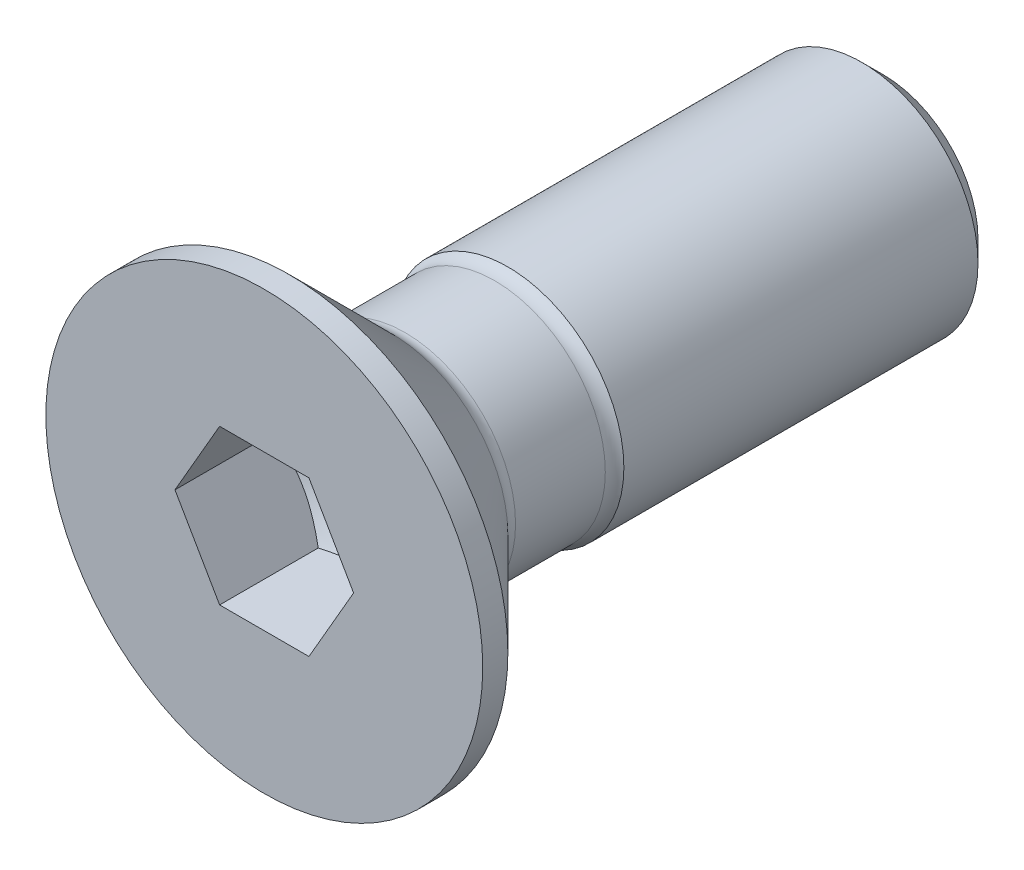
ISO-10303-21;
HEADER;
FILE_DESCRIPTION(('STEP AP214'),'2;1');
FILE_NAME('part.step','',(''),(''),'','','');
FILE_SCHEMA(('AUTOMOTIVE_DESIGN { 1 0 10303 214 1 1 1 1 }'));
ENDSEC;
DATA;
#1=APPLICATION_CONTEXT('core data for automotive mechanical design processes');
#2=APPLICATION_PROTOCOL_DEFINITION('international standard','automotive_design',2000,#1);
#3=PRODUCT_CONTEXT('',#1,'mechanical');
#4=PRODUCT('Part','Part','',(#3));
#5=PRODUCT_RELATED_PRODUCT_CATEGORY('part','',(#4));
#6=PRODUCT_DEFINITION_FORMATION('','',#4);
#7=PRODUCT_DEFINITION_CONTEXT('part definition',#1,'design');
#8=PRODUCT_DEFINITION('design','',#6,#7);
#9=PRODUCT_DEFINITION_SHAPE('','',#8);
#10=(LENGTH_UNIT() NAMED_UNIT(*) SI_UNIT(.MILLI.,.METRE.));
#11=(NAMED_UNIT(*) PLANE_ANGLE_UNIT() SI_UNIT($,.RADIAN.));
#12=(NAMED_UNIT(*) SI_UNIT($,.STERADIAN.) SOLID_ANGLE_UNIT());
#13=UNCERTAINTY_MEASURE_WITH_UNIT(LENGTH_MEASURE(1.E-05),#10,'distance_accuracy_value','');
#14=(GEOMETRIC_REPRESENTATION_CONTEXT(3) GLOBAL_UNCERTAINTY_ASSIGNED_CONTEXT((#13)) GLOBAL_UNIT_ASSIGNED_CONTEXT((#10,
#11,#12)) REPRESENTATION_CONTEXT('',''));
#15=CARTESIAN_POINT('',(0.,0.,0.));
#16=DIRECTION('',(0.,0.,1.));
#17=DIRECTION('',(1.,0.,0.));
#18=AXIS2_PLACEMENT_3D('',#15,#16,#17);
#19=CARTESIAN_POINT('',(0.,5.65,0.));
#20=DIRECTION('',(0.,0.,-1.));
#21=DIRECTION('',(-1.,0.,0.));
#22=AXIS2_PLACEMENT_3D('',#19,#20,#21);
#23=PLANE('',#22);
#24=CARTESIAN_POINT('',(0.,0.,0.));
#25=DIRECTION('',(0.,0.,1.));
#26=DIRECTION('',(1.,0.,0.));
#27=AXIS2_PLACEMENT_3D('',#24,#25,#26);
#28=CIRCLE('',#27,5.65);
#29=CARTESIAN_POINT('',(5.65,0.,0.));
#30=VERTEX_POINT('',#29);
#31=EDGE_CURVE('E107',#30,#30,#28,.T.);
#32=ORIENTED_EDGE('',*,*,#31,.T.);
#33=EDGE_LOOP('',(#32));
#34=FACE_BOUND('',#33,.T.);
#35=DIRECTION('',(0.5,-0.866025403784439,0.));
#36=VECTOR('',#35,1.);
#37=CARTESIAN_POINT('',(1.155,2.00051868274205,0.));
#38=LINE('',#37,#36);
#39=CARTESIAN_POINT('',(1.155,2.00051868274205,0.));
#40=VERTEX_POINT('',#39);
#41=CARTESIAN_POINT('',(2.31,0.,0.));
#42=VERTEX_POINT('',#41);
#43=EDGE_CURVE('E31',#40,#42,#38,.T.);
#44=ORIENTED_EDGE('',*,*,#43,.T.);
#45=DIRECTION('',(-0.5,-0.866025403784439,0.));
#46=VECTOR('',#45,1.);
#47=CARTESIAN_POINT('',(2.31,0.,0.));
#48=LINE('',#47,#46);
#49=CARTESIAN_POINT('',(1.155,-2.00051868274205,0.));
#50=VERTEX_POINT('',#49);
#51=EDGE_CURVE('E181',#42,#50,#48,.T.);
#52=ORIENTED_EDGE('',*,*,#51,.T.);
#53=DIRECTION('',(-1.,0.,0.));
#54=VECTOR('',#53,1.);
#55=CARTESIAN_POINT('',(1.155,-2.00051868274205,0.));
#56=LINE('',#55,#54);
#57=CARTESIAN_POINT('',(-1.155,-2.00051868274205,0.));
#58=VERTEX_POINT('',#57);
#59=EDGE_CURVE('E232',#50,#58,#56,.T.);
#60=ORIENTED_EDGE('',*,*,#59,.T.);
#61=DIRECTION('',(-0.5,0.866025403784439,0.));
#62=VECTOR('',#61,1.);
#63=CARTESIAN_POINT('',(-1.155,-2.00051868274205,0.));
#64=LINE('',#63,#62);
#65=CARTESIAN_POINT('',(-2.31,0.,0.));
#66=VERTEX_POINT('',#65);
#67=EDGE_CURVE('E230',#58,#66,#64,.T.);
#68=ORIENTED_EDGE('',*,*,#67,.T.);
#69=DIRECTION('',(0.5,0.866025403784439,0.));
#70=VECTOR('',#69,1.);
#71=CARTESIAN_POINT('',(-2.31,0.,0.));
#72=LINE('',#71,#70);
#73=CARTESIAN_POINT('',(-1.155,2.00051868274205,0.));
#74=VERTEX_POINT('',#73);
#75=EDGE_CURVE('E96',#66,#74,#72,.T.);
#76=ORIENTED_EDGE('',*,*,#75,.T.);
#77=DIRECTION('',(1.,0.,0.));
#78=VECTOR('',#77,1.);
#79=CARTESIAN_POINT('',(-1.155,2.00051868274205,0.));
#80=LINE('',#79,#78);
#81=EDGE_CURVE('E92',#74,#40,#80,.T.);
#82=ORIENTED_EDGE('',*,*,#81,.T.);
#83=EDGE_LOOP('',(#44,#52,#60,#68,#76,#82));
#84=FACE_BOUND('',#83,.T.);
#85=ADVANCED_FACE('F17',(#34,#84),#23,.F.);
#86=CARTESIAN_POINT('',(0.,0.,-16.));
#87=DIRECTION('',(0.,0.,1.));
#88=DIRECTION('',(1.,0.,0.));
#89=AXIS2_PLACEMENT_3D('',#86,#87,#88);
#90=PLANE('',#89);
#91=CARTESIAN_POINT('',(0.,0.,-16.));
#92=DIRECTION('',(0.,0.,1.));
#93=DIRECTION('',(1.,0.,0.));
#94=AXIS2_PLACEMENT_3D('',#91,#92,#93);
#95=CIRCLE('',#94,2.45875);
#96=CARTESIAN_POINT('',(2.45875,0.,-16.));
#97=VERTEX_POINT('',#96);
#98=EDGE_CURVE('E11',#97,#97,#95,.T.);
#99=ORIENTED_EDGE('',*,*,#98,.F.);
#100=EDGE_LOOP('',(#99));
#101=FACE_BOUND('',#100,.T.);
#102=ADVANCED_FACE('F132',(#101),#90,.F.);
#103=CARTESIAN_POINT('',(0.,0.,-16.));
#104=DIRECTION('',(0.,0.,1.));
#105=DIRECTION('',(1.,0.,0.));
#106=AXIS2_PLACEMENT_3D('',#103,#104,#105);
#107=CONICAL_SURFACE('',#106,2.45875,0.785398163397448);
#108=CARTESIAN_POINT('',(0.,0.,-15.45875));
#109=DIRECTION('',(0.,0.,1.));
#110=DIRECTION('',(1.,0.,0.));
#111=AXIS2_PLACEMENT_3D('',#108,#109,#110);
#112=CIRCLE('',#111,3.);
#113=CARTESIAN_POINT('',(3.,0.,-15.45875));
#114=VERTEX_POINT('',#113);
#115=EDGE_CURVE('E24',#114,#114,#112,.T.);
#116=ORIENTED_EDGE('',*,*,#115,.F.);
#117=EDGE_LOOP('',(#116));
#118=FACE_BOUND('',#117,.T.);
#119=ORIENTED_EDGE('',*,*,#98,.T.);
#120=EDGE_LOOP('',(#119));
#121=FACE_BOUND('',#120,.T.);
#122=ADVANCED_FACE('F129',(#118,#121),#107,.T.);
#123=CARTESIAN_POINT('',(0.,0.,0.));
#124=DIRECTION('',(0.,0.,1.));
#125=DIRECTION('',(1.,0.,0.));
#126=AXIS2_PLACEMENT_3D('',#123,#124,#125);
#127=CYLINDRICAL_SURFACE('',#126,3.);
#128=CARTESIAN_POINT('',(0.,0.,-6.3));
#129=DIRECTION('',(0.,0.,1.));
#130=DIRECTION('',(1.,0.,0.));
#131=AXIS2_PLACEMENT_3D('',#128,#129,#130);
#132=CIRCLE('',#131,3.);
#133=CARTESIAN_POINT('',(3.,0.,-6.3));
#134=VERTEX_POINT('',#133);
#135=EDGE_CURVE('E122',#134,#134,#132,.T.);
#136=ORIENTED_EDGE('',*,*,#135,.F.);
#137=EDGE_LOOP('',(#136));
#138=FACE_BOUND('',#137,.T.);
#139=ORIENTED_EDGE('',*,*,#115,.T.);
#140=EDGE_LOOP('',(#139));
#141=FACE_BOUND('',#140,.T.);
#142=ADVANCED_FACE('F127',(#138,#141),#127,.T.);
#143=CARTESIAN_POINT('',(0.,0.,-5.96058874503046));
#144=DIRECTION('',(0.,0.,1.));
#145=DIRECTION('',(1.,0.,0.));
#146=AXIS2_PLACEMENT_3D('',#143,#144,#145);
#147=TOROIDAL_SURFACE('',#146,3.33941125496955,0.48);
#148=ORIENTED_EDGE('',*,*,#135,.T.);
#149=EDGE_LOOP('',(#148));
#150=FACE_BOUND('',#149,.T.);
#151=CARTESIAN_POINT('',(0.,0.,-5.96058874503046));
#152=DIRECTION('',(0.,0.,1.));
#153=DIRECTION('',(1.,0.,0.));
#154=AXIS2_PLACEMENT_3D('',#151,#152,#153);
#155=CIRCLE('',#154,2.85941125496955);
#156=CARTESIAN_POINT('',(2.85941125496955,0.,-5.96058874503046));
#157=VERTEX_POINT('',#156);
#158=EDGE_CURVE('E119',#157,#157,#155,.T.);
#159=ORIENTED_EDGE('',*,*,#158,.F.);
#160=EDGE_LOOP('',(#159));
#161=FACE_BOUND('',#160,.T.);
#162=ADVANCED_FACE('F145',(#150,#161),#147,.F.);
#163=CARTESIAN_POINT('',(0.,0.,0.));
#164=DIRECTION('',(0.,0.,1.));
#165=DIRECTION('',(1.,0.,0.));
#166=AXIS2_PLACEMENT_3D('',#163,#164,#165);
#167=CYLINDRICAL_SURFACE('',#166,2.85941125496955);
#168=CARTESIAN_POINT('',(0.,0.,-3.63941125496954));
#169=DIRECTION('',(0.,0.,1.));
#170=DIRECTION('',(1.,0.,0.));
#171=AXIS2_PLACEMENT_3D('',#168,#169,#170);
#172=CIRCLE('',#171,2.85941125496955);
#173=CARTESIAN_POINT('',(2.85941125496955,0.,-3.63941125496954));
#174=VERTEX_POINT('',#173);
#175=EDGE_CURVE('E116',#174,#174,#172,.T.);
#176=ORIENTED_EDGE('',*,*,#175,.F.);
#177=EDGE_LOOP('',(#176));
#178=FACE_BOUND('',#177,.T.);
#179=ORIENTED_EDGE('',*,*,#158,.T.);
#180=EDGE_LOOP('',(#179));
#181=FACE_BOUND('',#180,.T.);
#182=ADVANCED_FACE('F149',(#178,#181),#167,.T.);
#183=CARTESIAN_POINT('',(0.,0.,-3.63941125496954));
#184=DIRECTION('',(0.,0.,1.));
#185=DIRECTION('',(1.,0.,0.));
#186=AXIS2_PLACEMENT_3D('',#183,#184,#185);
#187=TOROIDAL_SURFACE('',#186,3.33941125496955,0.48);
#188=ORIENTED_EDGE('',*,*,#175,.T.);
#189=EDGE_LOOP('',(#188));
#190=FACE_BOUND('',#189,.T.);
#191=CARTESIAN_POINT('',(0.,0.,-3.3));
#192=DIRECTION('',(0.,0.,1.));
#193=DIRECTION('',(1.,0.,0.));
#194=AXIS2_PLACEMENT_3D('',#191,#192,#193);
#195=CIRCLE('',#194,3.);
#196=CARTESIAN_POINT('',(3.,0.,-3.3));
#197=VERTEX_POINT('',#196);
#198=EDGE_CURVE('E113',#197,#197,#195,.T.);
#199=ORIENTED_EDGE('',*,*,#198,.F.);
#200=EDGE_LOOP('',(#199));
#201=FACE_BOUND('',#200,.T.);
#202=ADVANCED_FACE('F153',(#190,#201),#187,.F.);
#203=CARTESIAN_POINT('',(0.,0.,-3.3));
#204=DIRECTION('',(0.,0.,1.));
#205=DIRECTION('',(1.,0.,0.));
#206=AXIS2_PLACEMENT_3D('',#203,#204,#205);
#207=CONICAL_SURFACE('',#206,3.,0.785398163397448);
#208=CARTESIAN_POINT('',(0.,0.,-0.65));
#209=DIRECTION('',(0.,0.,1.));
#210=DIRECTION('',(1.,0.,0.));
#211=AXIS2_PLACEMENT_3D('',#208,#209,#210);
#212=CIRCLE('',#211,5.65);
#213=CARTESIAN_POINT('',(5.65,0.,-0.65));
#214=VERTEX_POINT('',#213);
#215=EDGE_CURVE('E110',#214,#214,#212,.T.);
#216=ORIENTED_EDGE('',*,*,#215,.F.);
#217=EDGE_LOOP('',(#216));
#218=FACE_BOUND('',#217,.T.);
#219=ORIENTED_EDGE('',*,*,#198,.T.);
#220=EDGE_LOOP('',(#219));
#221=FACE_BOUND('',#220,.T.);
#222=ADVANCED_FACE('F157',(#218,#221),#207,.T.);
#223=CARTESIAN_POINT('',(0.,0.,0.));
#224=DIRECTION('',(0.,0.,1.));
#225=DIRECTION('',(1.,0.,0.));
#226=AXIS2_PLACEMENT_3D('',#223,#224,#225);
#227=CYLINDRICAL_SURFACE('',#226,5.65);
#228=ORIENTED_EDGE('',*,*,#31,.F.);
#229=EDGE_LOOP('',(#228));
#230=FACE_BOUND('',#229,.T.);
#231=ORIENTED_EDGE('',*,*,#215,.T.);
#232=EDGE_LOOP('',(#231));
#233=FACE_BOUND('',#232,.T.);
#234=ADVANCED_FACE('F161',(#230,#233),#227,.T.);
#235=CARTESIAN_POINT('',(1.155,2.00051868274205,-3.88367912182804));
#236=DIRECTION('',(-0.866025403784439,-0.5,0.));
#237=DIRECTION('',(-0.5,0.866025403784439,0.));
#238=AXIS2_PLACEMENT_3D('',#235,#236,#237);
#239=PLANE('',#238);
#240=DIRECTION('',(0.,0.,1.));
#241=VECTOR('',#240,1.);
#242=CARTESIAN_POINT('',(2.31,0.,-3.88367912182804));
#243=LINE('',#242,#241);
#244=CARTESIAN_POINT('',(2.31,0.,-2.55));
#245=VERTEX_POINT('',#244);
#246=EDGE_CURVE('E105',#245,#42,#243,.T.);
#247=ORIENTED_EDGE('',*,*,#246,.T.);
#248=ORIENTED_EDGE('',*,*,#43,.F.);
#249=DIRECTION('',(0.,0.,1.));
#250=VECTOR('',#249,1.);
#251=CARTESIAN_POINT('',(1.155,2.00051868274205,-3.88367912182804));
#252=LINE('',#251,#250);
#253=CARTESIAN_POINT('',(1.155,2.00051868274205,-2.55));
#254=VERTEX_POINT('',#253);
#255=EDGE_CURVE('E86',#254,#40,#252,.T.);
#256=ORIENTED_EDGE('',*,*,#255,.F.);
#257=CARTESIAN_POINT('',(2.31000011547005,-1.99999999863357E-07,-2.54999993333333));
#258=CARTESIAN_POINT('',(2.25924485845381,0.0879104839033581,-2.57931199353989));
#259=CARTESIAN_POINT('',(2.20805148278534,0.176580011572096,-2.60596977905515));
#260=CARTESIAN_POINT('',(2.10477835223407,0.355454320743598,-2.65250014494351));
#261=CARTESIAN_POINT('',(2.05269676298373,0.445662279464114,-2.67235626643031));
#262=CARTESIAN_POINT('',(1.9491790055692,0.624960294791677,-2.70326375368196));
#263=CARTESIAN_POINT('',(1.89775876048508,0.71402277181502,-2.71452084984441));
#264=CARTESIAN_POINT('',(1.79467644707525,0.892566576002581,-2.72795696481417));
#265=CARTESIAN_POINT('',(1.7430147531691,0.982047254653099,-2.73014711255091));
#266=CARTESIAN_POINT('',(1.6464904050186,1.14923232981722,-2.72557924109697));
#267=CARTESIAN_POINT('',(1.60161326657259,1.22696181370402,-2.71994278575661));
#268=CARTESIAN_POINT('',(1.5121513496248,1.38191439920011,-2.70208213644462));
#269=CARTESIAN_POINT('',(1.46756688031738,1.45913696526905,-2.68985184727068));
#270=CARTESIAN_POINT('',(1.37792066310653,1.6144087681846,-2.65927848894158));
#271=CARTESIAN_POINT('',(1.33287025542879,1.69243836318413,-2.6408058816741));
#272=CARTESIAN_POINT('',(1.243441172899,1.8473340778,-2.59888087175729));
#273=CARTESIAN_POINT('',(1.19906135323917,1.92420218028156,-2.5754383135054));
#274=CARTESIAN_POINT('',(1.15499988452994,2.00051888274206,-2.54999993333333));
#275=B_SPLINE_CURVE_WITH_KNOTS('',3,(#257,#258,#259,#260,#261,#262,#263,#264,#265,#266,#267,
#268,#269,#270,#271,#272,#273,#274),.UNSPECIFIED.,.F.,.F.,(4,2,2,2,2,2,2,2,4),(0.,
0.317098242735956,0.634958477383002,0.944952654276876,1.25456622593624,1.52410310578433,
1.79388956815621,2.0696586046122,2.34488642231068),.UNSPECIFIED.);
#276=EDGE_CURVE('E79',#245,#254,#275,.T.);
#277=ORIENTED_EDGE('',*,*,#276,.F.);
#278=EDGE_LOOP('',(#247,#248,#256,#277));
#279=FACE_BOUND('',#278,.T.);
#280=ADVANCED_FACE('F87',(#279),#239,.T.);
#281=CARTESIAN_POINT('',(2.31,0.,-3.88367912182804));
#282=DIRECTION('',(-0.866025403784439,0.5,0.));
#283=DIRECTION('',(0.5,0.866025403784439,0.));
#284=AXIS2_PLACEMENT_3D('',#281,#282,#283);
#285=PLANE('',#284);
#286=DIRECTION('',(0.,0.,1.));
#287=VECTOR('',#286,1.);
#288=CARTESIAN_POINT('',(1.155,-2.00051868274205,-3.88367912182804));
#289=LINE('',#288,#287);
#290=CARTESIAN_POINT('',(1.155,-2.00051868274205,-2.55));
#291=VERTEX_POINT('',#290);
#292=EDGE_CURVE('E103',#291,#50,#289,.T.);
#293=ORIENTED_EDGE('',*,*,#292,.T.);
#294=ORIENTED_EDGE('',*,*,#51,.F.);
#295=ORIENTED_EDGE('',*,*,#246,.F.);
#296=CARTESIAN_POINT('',(1.15499988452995,-2.00051888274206,-2.54999993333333));
#297=CARTESIAN_POINT('',(1.20575514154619,-1.9126081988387,-2.57931199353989));
#298=CARTESIAN_POINT('',(1.25694851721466,-1.82393867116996,-2.60596977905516));
#299=CARTESIAN_POINT('',(1.36022164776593,-1.64506436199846,-2.65250014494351));
#300=CARTESIAN_POINT('',(1.41230323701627,-1.55485640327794,-2.67235626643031));
#301=CARTESIAN_POINT('',(1.5158209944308,-1.37555838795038,-2.70326375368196));
#302=CARTESIAN_POINT('',(1.56724123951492,-1.28649591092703,-2.71452084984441));
#303=CARTESIAN_POINT('',(1.67032355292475,-1.10795210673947,-2.72795696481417));
#304=CARTESIAN_POINT('',(1.7219852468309,-1.01847142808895,-2.73014711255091));
#305=CARTESIAN_POINT('',(1.8185095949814,-0.85128635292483,-2.72557924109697));
#306=CARTESIAN_POINT('',(1.86338673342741,-0.77355686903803,-2.71994278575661));
#307=CARTESIAN_POINT('',(1.9528486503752,-0.618604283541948,-2.70208213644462));
#308=CARTESIAN_POINT('',(1.99743311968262,-0.541381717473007,-2.68985184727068));
#309=CARTESIAN_POINT('',(2.08707933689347,-0.38610991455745,-2.65927848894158));
#310=CARTESIAN_POINT('',(2.13212974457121,-0.30808031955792,-2.6408058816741));
#311=CARTESIAN_POINT('',(2.221558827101,-0.153184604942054,-2.59888087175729));
#312=CARTESIAN_POINT('',(2.26593864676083,-0.0763165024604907,-2.5754383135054));
#313=CARTESIAN_POINT('',(2.31000011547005,2.00000000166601E-07,-2.54999993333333));
#314=B_SPLINE_CURVE_WITH_KNOTS('',3,(#296,#297,#298,#299,#300,#301,#302,#303,#304,#305,#306,
#307,#308,#309,#310,#311,#312,#313),.UNSPECIFIED.,.F.,.F.,(4,2,2,2,2,2,2,2,4),(0.,
0.317098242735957,0.634958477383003,0.944952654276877,1.25456622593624,1.52410310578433,
1.79388956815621,2.0696586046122,2.34488642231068),.UNSPECIFIED.);
#315=EDGE_CURVE('E83',#291,#245,#314,.T.);
#316=ORIENTED_EDGE('',*,*,#315,.F.);
#317=EDGE_LOOP('',(#293,#294,#295,#316));
#318=FACE_BOUND('',#317,.T.);
#319=ADVANCED_FACE('F169',(#318),#285,.T.);
#320=CARTESIAN_POINT('',(1.155,-2.00051868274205,-3.88367912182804));
#321=DIRECTION('',(0.,1.,0.));
#322=DIRECTION('',(1.,0.,0.));
#323=AXIS2_PLACEMENT_3D('',#320,#321,#322);
#324=PLANE('',#323);
#325=DIRECTION('',(0.,0.,1.));
#326=VECTOR('',#325,1.);
#327=CARTESIAN_POINT('',(-1.155,-2.00051868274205,-3.88367912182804));
#328=LINE('',#327,#326);
#329=CARTESIAN_POINT('',(-1.155,-2.00051868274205,-2.55));
#330=VERTEX_POINT('',#329);
#331=EDGE_CURVE('E101',#330,#58,#328,.T.);
#332=ORIENTED_EDGE('',*,*,#331,.T.);
#333=ORIENTED_EDGE('',*,*,#59,.F.);
#334=ORIENTED_EDGE('',*,*,#292,.F.);
#335=CARTESIAN_POINT('',(-2.99106574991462,-2.00051868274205,-1.80613655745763));
#336=CARTESIAN_POINT('',(-2.90467646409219,-2.00051868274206,-1.84758286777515));
#337=CARTESIAN_POINT('',(-2.81807672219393,-2.00051868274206,-1.88859868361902));
#338=CARTESIAN_POINT('',(-2.64434415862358,-2.00051868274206,-1.96952511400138));
#339=CARTESIAN_POINT('',(-2.55721124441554,-2.00051868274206,-2.0094355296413));
#340=CARTESIAN_POINT('',(-2.38180057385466,-2.00051868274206,-2.08812990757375));
#341=CARTESIAN_POINT('',(-2.29351907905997,-2.00051868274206,-2.12690556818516));
#342=CARTESIAN_POINT('',(-2.11621528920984,-2.00051868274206,-2.20271809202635));
#343=CARTESIAN_POINT('',(-2.02719303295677,-2.00051868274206,-2.23975504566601));
#344=CARTESIAN_POINT('',(-1.84592110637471,-2.00051868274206,-2.31257026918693));
#345=CARTESIAN_POINT('',(-1.7536479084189,-2.00051868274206,-2.34829031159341));
#346=CARTESIAN_POINT('',(-1.56798540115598,-2.00051868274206,-2.41676060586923));
#347=CARTESIAN_POINT('',(-1.4745959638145,-2.00051868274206,-2.44951051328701));
#348=CARTESIAN_POINT('',(-1.28676809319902,-2.00051868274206,-2.51110398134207));
#349=CARTESIAN_POINT('',(-1.19233265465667,-2.00051868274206,-2.53995657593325));
#350=CARTESIAN_POINT('',(-1.00210841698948,-2.00051868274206,-2.5927687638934));
#351=CARTESIAN_POINT('',(-0.906319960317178,-2.00051868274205,-2.61672957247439));
#352=CARTESIAN_POINT('',(-0.713588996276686,-2.00051868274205,-2.65848067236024));
#353=CARTESIAN_POINT('',(-0.616649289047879,-2.00051868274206,-2.67628363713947));
#354=CARTESIAN_POINT('',(-0.421685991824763,-2.00051868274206,-2.70455411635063));
#355=CARTESIAN_POINT('',(-0.323662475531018,-2.00051868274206,-2.7150221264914));
#356=CARTESIAN_POINT('',(-0.128245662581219,-2.00051868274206,-2.7276483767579));
#357=CARTESIAN_POINT('',(-0.0308588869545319,-2.00051868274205,-2.72990467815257));
#358=CARTESIAN_POINT('',(0.163753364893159,-2.00051868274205,-2.72617967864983));
#359=CARTESIAN_POINT('',(0.260978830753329,-2.00051868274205,-2.72019786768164));
#360=CARTESIAN_POINT('',(0.500868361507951,-2.00051868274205,-2.69580100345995));
#361=CARTESIAN_POINT('',(0.643067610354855,-2.00051868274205,-2.67281385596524));
#362=CARTESIAN_POINT('',(0.924700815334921,-2.00051868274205,-2.61353669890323));
#363=CARTESIAN_POINT('',(1.06413122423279,-2.00051868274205,-2.57723065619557));
#364=CARTESIAN_POINT('',(1.27266474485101,-2.00051868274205,-2.51521105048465));
#365=CARTESIAN_POINT('',(1.3428457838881,-2.00051868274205,-2.49298850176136));
#366=CARTESIAN_POINT('',(1.48247732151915,-2.00051868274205,-2.4464876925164));
#367=CARTESIAN_POINT('',(1.55192824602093,-2.00051868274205,-2.42221071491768));
#368=CARTESIAN_POINT('',(1.69019236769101,-2.00051868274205,-2.3719536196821));
#369=CARTESIAN_POINT('',(1.75900567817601,-2.00051868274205,-2.34597381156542));
#370=CARTESIAN_POINT('',(1.89609007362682,-2.00051868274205,-2.29259206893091));
#371=CARTESIAN_POINT('',(1.96436106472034,-2.00051868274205,-2.26518989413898));
#372=CARTESIAN_POINT('',(2.13862488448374,-2.00051868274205,-2.1934896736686));
#373=CARTESIAN_POINT('',(2.2442692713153,-2.00051868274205,-2.14834566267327));
#374=CARTESIAN_POINT('',(2.45460404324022,-2.00051868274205,-2.05588144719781));
#375=CARTESIAN_POINT('',(2.5592943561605,-2.00051868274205,-2.00856107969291));
#376=CARTESIAN_POINT('',(2.87225207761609,-2.00051868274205,-1.86410263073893));
#377=CARTESIAN_POINT('',(3.07937131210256,-2.00051868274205,-1.76448201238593));
#378=CARTESIAN_POINT('',(3.49184029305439,-2.00051868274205,-1.56106270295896));
#379=CARTESIAN_POINT('',(3.69718755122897,-2.00051868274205,-1.45725902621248));
#380=CARTESIAN_POINT('',(4.10647514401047,-2.00051868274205,-1.24698254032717));
#381=CARTESIAN_POINT('',(4.31041565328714,-2.00051868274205,-1.14051007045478));
#382=CARTESIAN_POINT('',(4.69811979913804,-2.00051868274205,-0.935862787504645));
#383=CARTESIAN_POINT('',(4.8819710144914,-2.00051868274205,-0.837853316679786));
#384=CARTESIAN_POINT('',(5.24908204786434,-2.00051868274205,-0.640717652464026));
#385=CARTESIAN_POINT('',(5.43234184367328,-2.00051868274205,-0.541591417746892));
#386=CARTESIAN_POINT('',(5.7979402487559,-2.00051868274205,-0.342755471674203));
#387=CARTESIAN_POINT('',(5.98028001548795,-2.00051868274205,-0.243047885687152));
#388=CARTESIAN_POINT('',(6.34459090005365,-2.00051868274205,-0.0429837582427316));
#389=CARTESIAN_POINT('',(6.52656203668,-2.00051868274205,0.0573727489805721));
#390=CARTESIAN_POINT('',(6.7084007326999,-2.00051868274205,0.157967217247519));
#391=B_SPLINE_CURVE_WITH_KNOTS('',3,(#335,#336,#337,#338,#339,#340,#341,#342,#343,#344,#345,
#346,#347,#348,#349,#350,#351,#352,#353,#354,#355,#356,#357,#358,#359,#360,#361,#362,#363,#364,
#365,#366,#367,#368,#369,#370,#371,#372,#373,#374,#375,#376,#377,#378,#379,#380,#381,#382,#383,
#384,#385,#386,#387,#388,#389,#390),.UNSPECIFIED.,.F.,.F.,(4,2,2,2,2,2,2,2,2,2,2,2,2,2,2,2,2,2,
2,2,2,2,2,2,2,2,2,4),(0.,0.287455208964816,0.574961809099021,0.864212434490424,1.15344800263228,
1.45024583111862,1.74707803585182,2.04320992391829,2.33926815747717,2.634713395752,
2.93013866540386,3.22202427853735,3.51392796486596,3.94517706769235,4.37694701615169,
4.59776874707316,4.8184535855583,5.03909842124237,5.25978065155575,5.60440213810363,
5.94904948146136,6.63845800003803,7.32871402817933,8.01888274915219,8.64390968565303,
9.26895982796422,9.89242014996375,10.5158478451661),.UNSPECIFIED.);
#392=EDGE_CURVE('E206',#330,#291,#391,.T.);
#393=ORIENTED_EDGE('',*,*,#392,.F.);
#394=EDGE_LOOP('',(#332,#333,#334,#393));
#395=FACE_BOUND('',#394,.T.);
#396=ADVANCED_FACE('F210',(#395),#324,.T.);
#397=CARTESIAN_POINT('',(-1.155,-2.00051868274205,-3.88367912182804));
#398=DIRECTION('',(0.866025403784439,0.5,0.));
#399=DIRECTION('',(0.5,-0.866025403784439,0.));
#400=AXIS2_PLACEMENT_3D('',#397,#398,#399);
#401=PLANE('',#400);
#402=DIRECTION('',(0.,0.,1.));
#403=VECTOR('',#402,1.);
#404=CARTESIAN_POINT('',(-2.31,0.,-3.88367912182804));
#405=LINE('',#404,#403);
#406=CARTESIAN_POINT('',(-2.31,0.,-2.55));
#407=VERTEX_POINT('',#406);
#408=EDGE_CURVE('E94',#407,#66,#405,.T.);
#409=ORIENTED_EDGE('',*,*,#408,.T.);
#410=ORIENTED_EDGE('',*,*,#67,.F.);
#411=ORIENTED_EDGE('',*,*,#331,.F.);
#412=CARTESIAN_POINT('',(-2.31000011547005,1.99999999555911E-07,-2.54999993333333));
#413=CARTESIAN_POINT('',(-2.25924485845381,-0.0879104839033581,-2.57931199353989));
#414=CARTESIAN_POINT('',(-2.20805148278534,-0.176580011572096,-2.60596977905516));
#415=CARTESIAN_POINT('',(-2.10477835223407,-0.355454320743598,-2.65250014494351));
#416=CARTESIAN_POINT('',(-2.05269676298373,-0.445662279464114,-2.67235626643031));
#417=CARTESIAN_POINT('',(-1.9491790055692,-0.624960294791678,-2.70326375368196));
#418=CARTESIAN_POINT('',(-1.89775876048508,-0.714022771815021,-2.71452084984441));
#419=CARTESIAN_POINT('',(-1.79467644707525,-0.892566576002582,-2.72795696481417));
#420=CARTESIAN_POINT('',(-1.7430147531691,-0.982047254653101,-2.73014711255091));
#421=CARTESIAN_POINT('',(-1.6464904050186,-1.14923232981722,-2.72557924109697));
#422=CARTESIAN_POINT('',(-1.60161326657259,-1.22696181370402,-2.71994278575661));
#423=CARTESIAN_POINT('',(-1.5121513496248,-1.38191439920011,-2.70208213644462));
#424=CARTESIAN_POINT('',(-1.46756688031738,-1.45913696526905,-2.68985184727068));
#425=CARTESIAN_POINT('',(-1.37792066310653,-1.6144087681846,-2.65927848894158));
#426=CARTESIAN_POINT('',(-1.33287025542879,-1.69243836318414,-2.6408058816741));
#427=CARTESIAN_POINT('',(-1.243441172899,-1.8473340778,-2.59888087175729));
#428=CARTESIAN_POINT('',(-1.19906135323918,-1.92420218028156,-2.5754383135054));
#429=CARTESIAN_POINT('',(-1.15499988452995,-2.00051888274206,-2.54999993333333));
#430=B_SPLINE_CURVE_WITH_KNOTS('',3,(#412,#413,#414,#415,#416,#417,#418,#419,#420,#421,#422,
#423,#424,#425,#426,#427,#428,#429),.UNSPECIFIED.,.F.,.F.,(4,2,2,2,2,2,2,2,4),(0.,
0.317098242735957,0.634958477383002,0.944952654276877,1.25456622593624,1.52410310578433,
1.79388956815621,2.0696586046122,2.34488642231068),.UNSPECIFIED.);
#431=EDGE_CURVE('E201',#407,#330,#430,.T.);
#432=ORIENTED_EDGE('',*,*,#431,.F.);
#433=EDGE_LOOP('',(#409,#410,#411,#432));
#434=FACE_BOUND('',#433,.T.);
#435=ADVANCED_FACE('F213',(#434),#401,.T.);
#436=CARTESIAN_POINT('',(-2.31,0.,-3.88367912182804));
#437=DIRECTION('',(0.866025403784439,-0.5,0.));
#438=DIRECTION('',(-0.5,-0.866025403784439,0.));
#439=AXIS2_PLACEMENT_3D('',#436,#437,#438);
#440=PLANE('',#439);
#441=DIRECTION('',(0.,0.,1.));
#442=VECTOR('',#441,1.);
#443=CARTESIAN_POINT('',(-1.155,2.00051868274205,-3.88367912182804));
#444=LINE('',#443,#442);
#445=CARTESIAN_POINT('',(-1.155,2.00051868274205,-2.55));
#446=VERTEX_POINT('',#445);
#447=EDGE_CURVE('E91',#446,#74,#444,.T.);
#448=ORIENTED_EDGE('',*,*,#447,.T.);
#449=ORIENTED_EDGE('',*,*,#75,.F.);
#450=ORIENTED_EDGE('',*,*,#408,.F.);
#451=CARTESIAN_POINT('',(-1.15499988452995,2.00051888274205,-2.54999993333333));
#452=CARTESIAN_POINT('',(-1.20575514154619,1.91260819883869,-2.5793119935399));
#453=CARTESIAN_POINT('',(-1.25694851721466,1.82393867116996,-2.60596977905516));
#454=CARTESIAN_POINT('',(-1.36022164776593,1.64506436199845,-2.65250014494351));
#455=CARTESIAN_POINT('',(-1.41230323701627,1.55485640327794,-2.67235626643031));
#456=CARTESIAN_POINT('',(-1.5158209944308,1.37555838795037,-2.70326375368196));
#457=CARTESIAN_POINT('',(-1.56724123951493,1.28649591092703,-2.71452084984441));
#458=CARTESIAN_POINT('',(-1.67032355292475,1.10795210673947,-2.72795696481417));
#459=CARTESIAN_POINT('',(-1.7219852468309,1.01847142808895,-2.73014711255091));
#460=CARTESIAN_POINT('',(-1.8185095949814,0.851286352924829,-2.72557924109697));
#461=CARTESIAN_POINT('',(-1.86338673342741,0.773556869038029,-2.71994278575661));
#462=CARTESIAN_POINT('',(-1.9528486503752,0.618604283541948,-2.70208213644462));
#463=CARTESIAN_POINT('',(-1.99743311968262,0.541381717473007,-2.68985184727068));
#464=CARTESIAN_POINT('',(-2.08707933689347,0.38610991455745,-2.65927848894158));
#465=CARTESIAN_POINT('',(-2.13212974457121,0.308080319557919,-2.6408058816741));
#466=CARTESIAN_POINT('',(-2.221558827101,0.153184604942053,-2.59888087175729));
#467=CARTESIAN_POINT('',(-2.26593864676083,0.0763165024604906,-2.5754383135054));
#468=CARTESIAN_POINT('',(-2.31000011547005,-2.00000000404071E-07,-2.54999993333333));
#469=B_SPLINE_CURVE_WITH_KNOTS('',3,(#451,#452,#453,#454,#455,#456,#457,#458,#459,#460,#461,
#462,#463,#464,#465,#466,#467,#468),.UNSPECIFIED.,.F.,.F.,(4,2,2,2,2,2,2,2,4),(0.,
0.317098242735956,0.634958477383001,0.944952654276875,1.25456622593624,1.52410310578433,
1.7938895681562,2.0696586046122,2.34488642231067),.UNSPECIFIED.);
#470=EDGE_CURVE('E39',#446,#407,#469,.T.);
#471=ORIENTED_EDGE('',*,*,#470,.F.);
#472=EDGE_LOOP('',(#448,#449,#450,#471));
#473=FACE_BOUND('',#472,.T.);
#474=ADVANCED_FACE('F217',(#473),#440,.T.);
#475=CARTESIAN_POINT('',(-1.155,2.00051868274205,-3.88367912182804));
#476=DIRECTION('',(0.,-1.,0.));
#477=DIRECTION('',(-1.,0.,0.));
#478=AXIS2_PLACEMENT_3D('',#475,#476,#477);
#479=PLANE('',#478);
#480=ORIENTED_EDGE('',*,*,#255,.T.);
#481=ORIENTED_EDGE('',*,*,#81,.F.);
#482=ORIENTED_EDGE('',*,*,#447,.F.);
#483=CARTESIAN_POINT('',(-2.99106574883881,2.00051868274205,-1.80613655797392));
#484=CARTESIAN_POINT('',(-2.90467646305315,2.00051868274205,-1.8475828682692));
#485=CARTESIAN_POINT('',(-2.81807672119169,2.00051868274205,-1.88859868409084));
#486=CARTESIAN_POINT('',(-2.64434415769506,2.00051868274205,-1.96952511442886));
#487=CARTESIAN_POINT('',(-2.55721124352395,2.00051868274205,-2.00943553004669));
#488=CARTESIAN_POINT('',(-2.38180057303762,2.00051868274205,-2.0881299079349));
#489=CARTESIAN_POINT('',(-2.29351907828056,2.00051868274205,-2.12690556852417));
#490=CARTESIAN_POINT('',(-2.11621528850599,2.00051868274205,-2.20271809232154));
#491=CARTESIAN_POINT('',(-2.02719303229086,2.00051868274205,-2.23975504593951));
#492=CARTESIAN_POINT('',(-1.84592110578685,2.00051868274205,-2.3125702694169));
#493=CARTESIAN_POINT('',(-1.7536479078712,2.00051868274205,-2.34829031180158));
#494=CARTESIAN_POINT('',(-1.56798540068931,2.00051868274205,-2.41676060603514));
#495=CARTESIAN_POINT('',(-1.4745959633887,2.00051868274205,-2.44951051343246));
#496=CARTESIAN_POINT('',(-1.28676809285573,2.00051868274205,-2.51110398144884));
#497=CARTESIAN_POINT('',(-1.19233265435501,2.00051868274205,-2.5399565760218));
#498=CARTESIAN_POINT('',(-1.00210841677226,2.00051868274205,-2.59276876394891));
#499=CARTESIAN_POINT('',(-0.906319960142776,2.00051868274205,-2.61672957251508));
#500=CARTESIAN_POINT('',(-0.713588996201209,2.00051868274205,-2.6584806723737));
#501=CARTESIAN_POINT('',(-0.616649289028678,2.00051868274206,-2.67628363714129));
#502=CARTESIAN_POINT('',(-0.421685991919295,2.00051868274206,-2.70455411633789));
#503=CARTESIAN_POINT('',(-0.323662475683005,2.00051868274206,-2.71502212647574));
#504=CARTESIAN_POINT('',(-0.128245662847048,2.00051868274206,-2.72764837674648));
#505=CARTESIAN_POINT('',(-0.0308588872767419,2.00051868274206,-2.72990467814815));
#506=CARTESIAN_POINT('',(0.163753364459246,2.00051868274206,-2.72617967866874));
#507=CARTESIAN_POINT('',(0.260978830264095,2.00051868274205,-2.7201978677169));
#508=CARTESIAN_POINT('',(0.500868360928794,2.00051868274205,-2.6958010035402));
#509=CARTESIAN_POINT('',(0.643067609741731,2.00051868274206,-2.6728138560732));
#510=CARTESIAN_POINT('',(0.924700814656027,2.00051868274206,-2.61353669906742));
#511=CARTESIAN_POINT('',(1.0641312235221,2.00051868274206,-2.57723065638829));
#512=CARTESIAN_POINT('',(1.27266474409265,2.00051868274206,-2.51521105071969));
#513=CARTESIAN_POINT('',(1.34284578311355,2.00051868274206,-2.49298850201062));
#514=CARTESIAN_POINT('',(1.48247732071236,2.00051868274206,-2.44648769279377));
#515=CARTESIAN_POINT('',(1.5519282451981,2.00051868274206,-2.42221071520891));
#516=CARTESIAN_POINT('',(1.69019236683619,2.00051868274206,-2.37195362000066));
#517=CARTESIAN_POINT('',(1.75900567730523,2.00051868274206,-2.34597381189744));
#518=CARTESIAN_POINT('',(1.89609007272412,2.00051868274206,-2.29259206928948));
#519=CARTESIAN_POINT('',(1.96436106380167,2.00051868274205,-2.26518989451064));
#520=CARTESIAN_POINT('',(2.13862488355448,2.00051868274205,-2.19348967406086));
#521=CARTESIAN_POINT('',(2.24426927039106,2.00051868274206,-2.14834566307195));
#522=CARTESIAN_POINT('',(2.45460404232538,2.00051868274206,-2.05588144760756));
#523=CARTESIAN_POINT('',(2.55929435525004,2.00051868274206,-2.00856108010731));
#524=CARTESIAN_POINT('',(2.87225207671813,2.00051868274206,-1.8641026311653));
#525=CARTESIAN_POINT('',(3.07937131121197,2.00051868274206,-1.76448201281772));
#526=CARTESIAN_POINT('',(3.49184029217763,2.00051868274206,-1.5610627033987));
#527=CARTESIAN_POINT('',(3.69718755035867,2.00051868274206,-1.45725902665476));
#528=CARTESIAN_POINT('',(4.10647514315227,2.00051868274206,-1.24698254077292));
#529=CARTESIAN_POINT('',(4.31041565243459,2.00051868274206,-1.14051007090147));
#530=CARTESIAN_POINT('',(4.69811979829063,2.00051868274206,-0.935862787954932));
#531=CARTESIAN_POINT('',(4.88197101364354,2.00051868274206,-0.837853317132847));
#532=CARTESIAN_POINT('',(5.24908204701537,2.00051868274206,-0.640717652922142));
#533=CARTESIAN_POINT('',(5.43234184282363,2.00051868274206,-0.541591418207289));
#534=CARTESIAN_POINT('',(5.7979402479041,2.00051868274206,-0.342755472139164));
#535=CARTESIAN_POINT('',(5.98028001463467,2.00051868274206,-0.243047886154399));
#536=CARTESIAN_POINT('',(6.34459089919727,2.00051868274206,-0.0429837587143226));
#537=CARTESIAN_POINT('',(6.526562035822,2.00051868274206,0.0573727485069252));
#538=CARTESIAN_POINT('',(6.70840073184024,2.00051868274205,0.157967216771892));
#539=B_SPLINE_CURVE_WITH_KNOTS('',3,(#483,#484,#485,#486,#487,#488,#489,#490,#491,#492,#493,
#494,#495,#496,#497,#498,#499,#500,#501,#502,#503,#504,#505,#506,#507,#508,#509,#510,#511,#512,
#513,#514,#515,#516,#517,#518,#519,#520,#521,#522,#523,#524,#525,#526,#527,#528,#529,#530,#531,
#532,#533,#534,#535,#536,#537,#538),.UNSPECIFIED.,.F.,.F.,(4,2,2,2,2,2,2,2,2,2,2,2,2,2,2,2,2,2,
2,2,2,2,2,2,2,2,2,4),(0.,0.28745520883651,0.574961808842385,0.864212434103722,1.15344800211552,
1.45024583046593,1.74707803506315,2.04320992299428,2.33926815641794,2.63471339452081,
2.93013866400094,3.22202427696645,3.51392796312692,3.94517706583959,4.37694701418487,
4.59776874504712,4.81845358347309,5.0390984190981,5.25978064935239,5.60440213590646,
5.94904947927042,6.63845799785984,7.32871402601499,8.01888274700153,8.64390968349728,
9.26895982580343,9.89242014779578,10.5158478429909),.UNSPECIFIED.);
#540=EDGE_CURVE('E80',#254,#446,#539,.F.);
#541=ORIENTED_EDGE('',*,*,#540,.F.);
#542=EDGE_LOOP('',(#480,#481,#482,#541));
#543=FACE_BOUND('',#542,.T.);
#544=ADVANCED_FACE('F75',(#543),#479,.T.);
#545=CARTESIAN_POINT('',(0.,0.,-3.88367912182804));
#546=DIRECTION('',(0.,0.,1.));
#547=DIRECTION('',(1.,0.,0.));
#548=AXIS2_PLACEMENT_3D('',#545,#546,#547);
#549=CONICAL_SURFACE('',#548,0.,1.0471975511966);
#550=CARTESIAN_POINT('',(0.,0.,-3.88367912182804));
#551=VERTEX_POINT('',#550);
#552=VERTEX_LOOP('',#551);
#553=FACE_BOUND('',#552,.T.);
#554=ORIENTED_EDGE('',*,*,#276,.T.);
#555=ORIENTED_EDGE('',*,*,#540,.T.);
#556=ORIENTED_EDGE('',*,*,#470,.T.);
#557=ORIENTED_EDGE('',*,*,#431,.T.);
#558=ORIENTED_EDGE('',*,*,#392,.T.);
#559=ORIENTED_EDGE('',*,*,#315,.T.);
#560=EDGE_LOOP('',(#554,#555,#556,#557,#558,#559));
#561=FACE_BOUND('',#560,.T.);
#562=ADVANCED_FACE('F72',(#553,#561),#549,.F.);
#563=CLOSED_SHELL('',(#85,#102,#122,#142,#162,#182,#202,#222,#234,#280,#319,#396,#435,#474,#544,#562));
#564=MANIFOLD_SOLID_BREP('B1',#563);
#565=ADVANCED_BREP_SHAPE_REPRESENTATION('',(#18,#564),#14);
#566=SHAPE_DEFINITION_REPRESENTATION(#9,#565);
ENDSEC;
END-ISO-10303-21;
